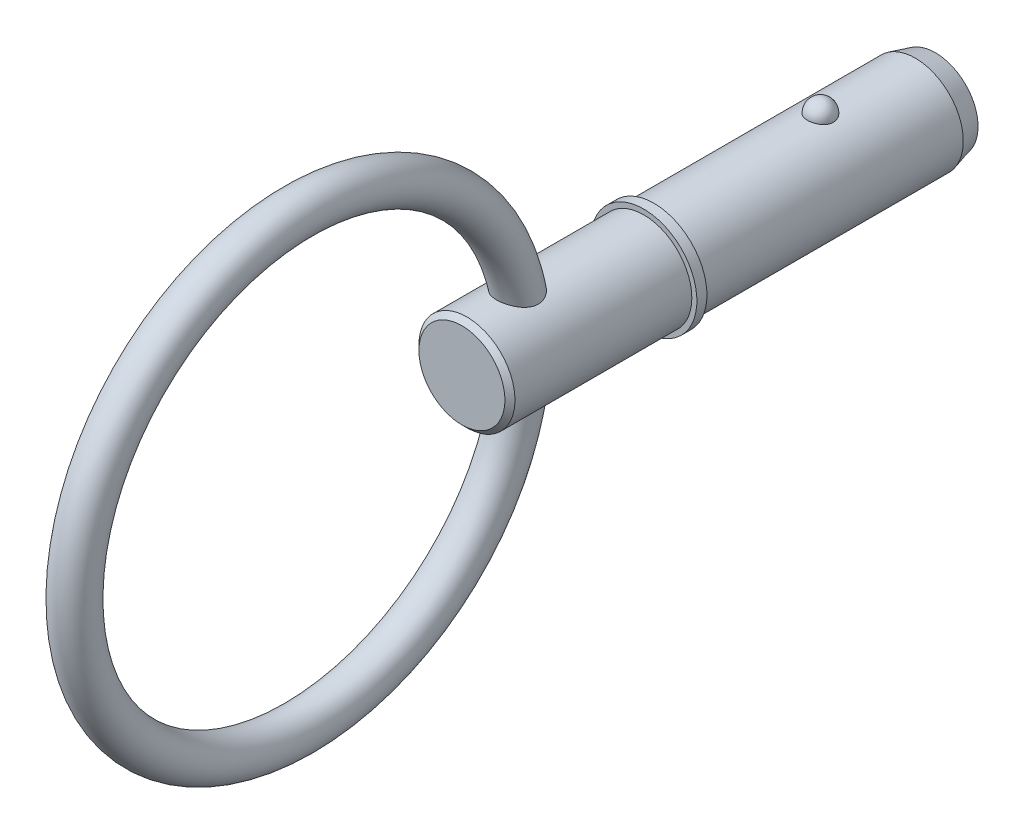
from build123d import *

# Parameters (mm, degrees)
SKETCH2_R           = 4.765
BOSS_EXTRUDE1_DEPTH = 15.24
BOSS_EXTRUDE2_START = 12.7
SKETCH3_R           = 4.765
BOSS_EXTRUDE2_DEPTH = 12.7
CHAMFER1_SIZE       = 2
CHAMFER1_SIZE2      = 0.535898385
SKETCH20_W          = 1
SKETCH20_H          = 5.265
SKETCH21_R          = 4.765
BOSS_EXTRUDE3_DEPTH = 19.05
CHAMFER2_SIZE       = 0.5
SKETCH24_R          = 2


with BuildPart() as part:
    # Sketch2 → Boss-Extrude1 (new body)
    with BuildSketch(Plane.XY):
        Circle(SKETCH2_R)
    extrude(amount=BOSS_EXTRUDE1_DEPTH)

    # Sketch3 → Boss-Extrude2 (add)
    with BuildSketch(Plane(origin=(0, 0, 0), x_dir=(-1, 0, 0), z_dir=(0, 0, -1)).offset(BOSS_EXTRUDE2_START)):
        Circle(SKETCH3_R)
    extrude(amount=-BOSS_EXTRUDE2_DEPTH)

    # Chamfer1
    chamfer1_edges = [part.edges().sort_by_distance(p)[0] for p in [
        (4.765, 0, -12.7),
    ]]
    chamfer1_side = [part.faces().sort_by_distance(p)[0] for p in [
        (4.765, 0, -6.35),
    ]]
    chamfer(chamfer1_edges, length=CHAMFER1_SIZE, length2=CHAMFER1_SIZE2, reference=chamfer1_side[0])

    # Sketch18 → Revolve1 (revolve)
    with BuildSketch(Plane(origin=(0, 0, 0), x_dir=(0, 0, -1), z_dir=(1, 0, 0))):
        with BuildLine():
            Line((1.29, 6.055), (1.29, 3.475))
            ThreePointArc((1.29, 3.475), (0, 4.765), (1.29, 6.055))
        make_face()
    revolve(axis=Axis((0, 6.055, -1.29), (0, -1, 0)))

    # Sketch20 → Revolve2 (revolve)
    with BuildSketch(Plane(origin=(0, 0, 0), x_dir=(0, 0, -1), z_dir=(1, 0, 0)), mode=Mode.PRIVATE) as revolve2_sk:
        with Locations((-15.74, 2.6325)):
            Rectangle(SKETCH20_W, SKETCH20_H)
    revolve(revolve2_sk.sketch.rotate(Axis((0, 0, 33.728787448), (0, 0, 1)), 90), axis=Axis((0, 0, 33.728787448), (0, 0, 1)))

    # Sketch21 → Boss-Extrude3 (add)
    with BuildSketch(Plane(origin=(0, 0, 15.24), x_dir=(-1, 0, 0), z_dir=(0, 0, -1))):
        Circle(SKETCH21_R)
    extrude(amount=-BOSS_EXTRUDE3_DEPTH)

    # Chamfer2
    chamfer2_edges = [part.edges().sort_by_distance(p)[0] for p in [
        (4.765, 0, 34.29),
    ]]
    chamfer(chamfer2_edges, length=CHAMFER2_SIZE)

    # Sweep1: sweep along a path in Sketch23
    with BuildLine(Plane(origin=(0, 0, 0), x_dir=(0, 0, -1), z_dir=(1, 0, 0))) as sweep1_path:
        CenterArc((-50.515, 0), 22.225, 0, 360)
    # Sketch24 → Sweep1 (sweep)
    with BuildSketch(Plane(origin=(0, 0, 0), x_dir=(1, 0, 0), z_dir=(0, 1, 0))):
        with Locations((0, -28.29)):
            Circle(SKETCH24_R)
    sweep(path=sweep1_path.line)


solid = part.part
